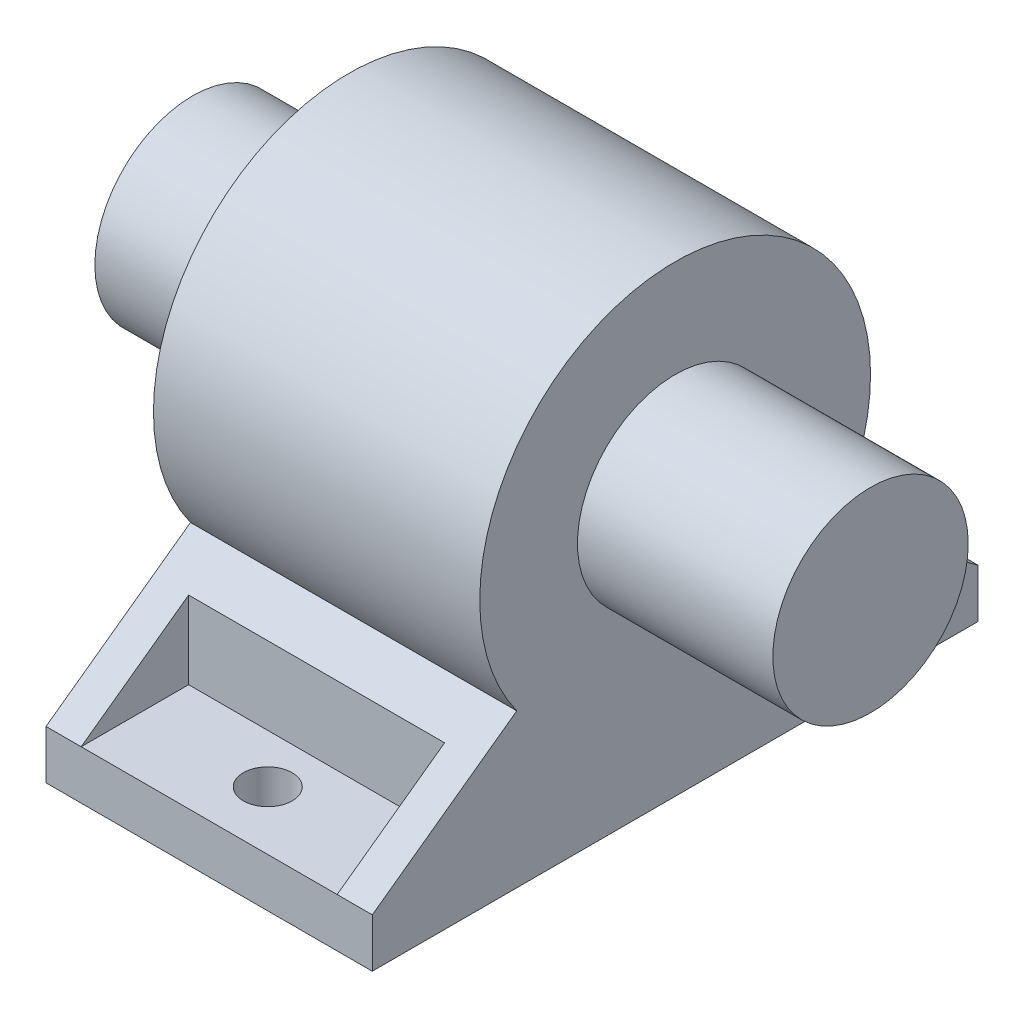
from build123d import *

# Parameters (mm, degrees)
BOSS_EXTRUDE1_DEPTH    = 42.418
SKETCH2_R              = 12.7
BOSS_EXTRUDE2_DEPTH    = 25.4
BOSS_EXTRUDE3_START    = 20.32
SKETCH3_R              = 12.7
BOSS_EXTRUDE3_DEPTH    = 20.32
SKETCH4_W              = 33.274
SKETCH4_H              = 13.97
CUT_EXTRUDE1_DEPTH     = 28.448
MOUNT_HOLES_DEPTH      = 86.791484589
MOUNT_HOLES_DEPTH_BACK = 86.791484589
SKETCH5_R              = 3.175


with BuildPart() as part:
    # Sketch1 → Boss-Extrude1 (new body)
    with BuildSketch(Plane(origin=(0, 0, 0), x_dir=(0, 0, -1), z_dir=(1, 0, 0))):
        with BuildLine():
            Line((-39.37, -34.798), (39.37, -34.798))
            Line((39.37, -34.798), (39.37, -28.448))
            Line((39.37, -28.448), (20.587749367, -14.87630922))
            ThreePointArc((20.587749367, -14.87630922), (0, 25.4), (-20.587749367, -14.87630922))
            Line((-20.587749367, -14.87630922), (-39.37, -28.448))
            Line((-39.37, -28.448), (-39.37, -34.798))
        make_face()
    extrude(amount=BOSS_EXTRUDE1_DEPTH)

    # Sketch2 → Boss-Extrude2 (add)
    with BuildSketch(Plane(origin=(42.418, 0, 0), x_dir=(0, 0, -1), z_dir=(1, 0, 0))):
        Circle(SKETCH2_R)
    extrude(amount=BOSS_EXTRUDE2_DEPTH)

    # Sketch3 → Boss-Extrude3 (add)
    with BuildSketch(Plane.ZY.offset(BOSS_EXTRUDE3_START)):
        with Locations(Location((0, 0, 0), (0, 0, 180))):
            Circle(SKETCH3_R)
    extrude(amount=-BOSS_EXTRUDE3_DEPTH)

    # Sketch4 → Cut-Extrude1 (cut)
    with BuildSketch(Plane(origin=(0, 0, 0), x_dir=(1, 0, 0), z_dir=(0, 1, 0))):
        with Locations((21.209, -32.385)):
            Rectangle(SKETCH4_W, SKETCH4_H)
        with Locations((21.209, 32.385)):
            Rectangle(SKETCH4_W, SKETCH4_H)
    extrude(amount=-CUT_EXTRUDE1_DEPTH, mode=Mode.SUBTRACT)

    # Sketch5 → Mount Holes (cut, two sides: drawn at the far end of the back side and taken through both)
    with BuildSketch(Plane(origin=(0, 0, 0), x_dir=(1, 0, 0), z_dir=(0, 1, 0)).offset(-MOUNT_HOLES_DEPTH_BACK)):
        with Locations(Location((21.209, 31.75, 0), (0, 0, 270))):
            Circle(SKETCH5_R)
        with Locations(Location((21.209, -31.75, 0), (0, 0, 270))):
            Circle(SKETCH5_R)
    extrude(amount=MOUNT_HOLES_DEPTH + MOUNT_HOLES_DEPTH_BACK, mode=Mode.SUBTRACT)


solid = part.part
